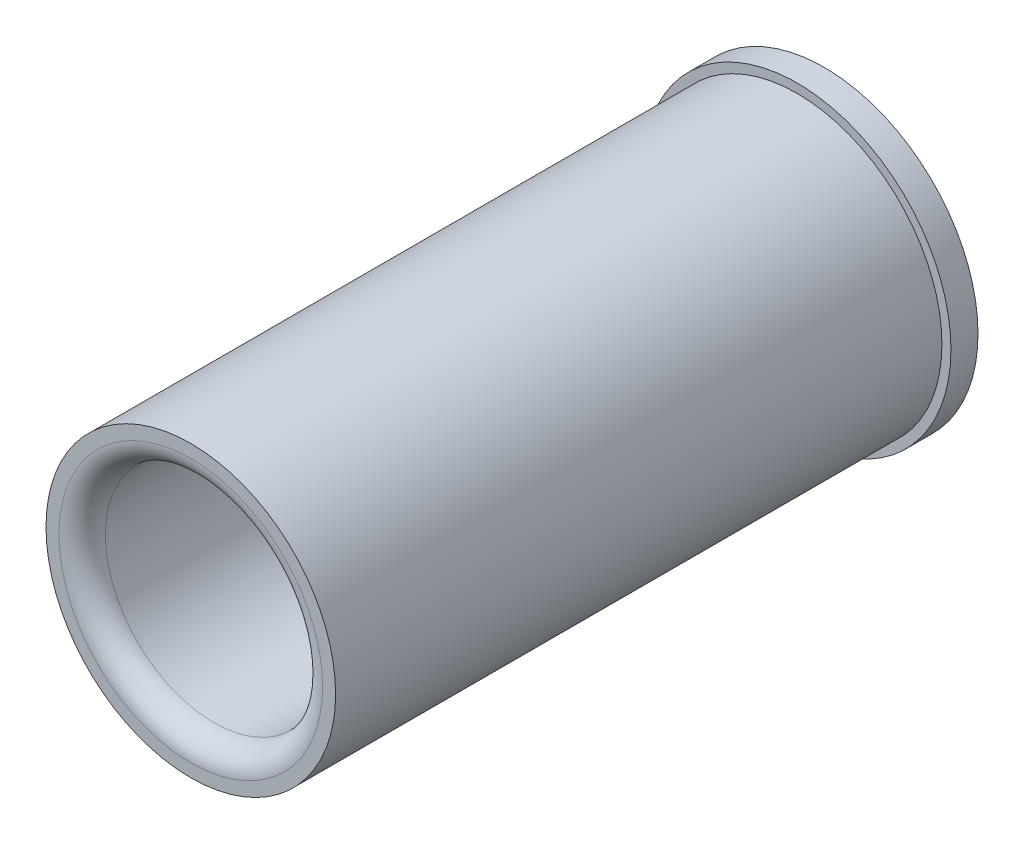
ISO-10303-21;
HEADER;
FILE_DESCRIPTION(('STEP AP214'),'2;1');
FILE_NAME('part.step','',(''),(''),'','','');
FILE_SCHEMA(('AUTOMOTIVE_DESIGN { 1 0 10303 214 1 1 1 1 }'));
ENDSEC;
DATA;
#1=APPLICATION_CONTEXT('core data for automotive mechanical design processes');
#2=APPLICATION_PROTOCOL_DEFINITION('international standard','automotive_design',2000,#1);
#3=PRODUCT_CONTEXT('',#1,'mechanical');
#4=PRODUCT('Part','Part','',(#3));
#5=PRODUCT_RELATED_PRODUCT_CATEGORY('part','',(#4));
#6=PRODUCT_DEFINITION_FORMATION('','',#4);
#7=PRODUCT_DEFINITION_CONTEXT('part definition',#1,'design');
#8=PRODUCT_DEFINITION('design','',#6,#7);
#9=PRODUCT_DEFINITION_SHAPE('','',#8);
#10=(LENGTH_UNIT() NAMED_UNIT(*) SI_UNIT(.MILLI.,.METRE.));
#11=(NAMED_UNIT(*) PLANE_ANGLE_UNIT() SI_UNIT($,.RADIAN.));
#12=(NAMED_UNIT(*) SI_UNIT($,.STERADIAN.) SOLID_ANGLE_UNIT());
#13=UNCERTAINTY_MEASURE_WITH_UNIT(LENGTH_MEASURE(1.E-05),#10,'distance_accuracy_value','');
#14=(GEOMETRIC_REPRESENTATION_CONTEXT(3) GLOBAL_UNCERTAINTY_ASSIGNED_CONTEXT((#13)) GLOBAL_UNIT_ASSIGNED_CONTEXT((#10,
#11,#12)) REPRESENTATION_CONTEXT('',''));
#15=CARTESIAN_POINT('',(0.,0.,0.));
#16=DIRECTION('',(0.,0.,1.));
#17=DIRECTION('',(1.,0.,0.));
#18=AXIS2_PLACEMENT_3D('',#15,#16,#17);
#19=CARTESIAN_POINT('',(0.,0.,111.125));
#20=DIRECTION('',(0.,0.,-1.));
#21=DIRECTION('',(-1.,0.,0.));
#22=AXIS2_PLACEMENT_3D('',#19,#20,#21);
#23=CYLINDRICAL_SURFACE('',#22,25.40635);
#24=CARTESIAN_POINT('',(0.,0.,4.7498));
#25=DIRECTION('',(0.,0.,1.));
#26=DIRECTION('',(1.,0.,0.));
#27=AXIS2_PLACEMENT_3D('',#24,#25,#26);
#28=CIRCLE('',#27,25.40635);
#29=CARTESIAN_POINT('',(25.40635,0.,4.7498));
#30=VERTEX_POINT('',#29);
#31=EDGE_CURVE('E70',#30,#30,#28,.T.);
#32=ORIENTED_EDGE('',*,*,#31,.T.);
#33=EDGE_LOOP('',(#32));
#34=FACE_BOUND('',#33,.T.);
#35=CARTESIAN_POINT('',(0.,0.,111.125));
#36=DIRECTION('',(0.,0.,1.));
#37=DIRECTION('',(1.,0.,0.));
#38=AXIS2_PLACEMENT_3D('',#35,#36,#37);
#39=CIRCLE('',#38,25.40635);
#40=CARTESIAN_POINT('',(25.40635,0.,111.125));
#41=VERTEX_POINT('',#40);
#42=EDGE_CURVE('E64',#41,#41,#39,.T.);
#43=ORIENTED_EDGE('',*,*,#42,.F.);
#44=EDGE_LOOP('',(#43));
#45=FACE_BOUND('',#44,.T.);
#46=ADVANCED_FACE('F36',(#34,#45),#23,.T.);
#47=CARTESIAN_POINT('',(0.,0.,111.125));
#48=DIRECTION('',(0.,0.,1.));
#49=DIRECTION('',(1.,0.,0.));
#50=AXIS2_PLACEMENT_3D('',#47,#48,#49);
#51=PLANE('',#50);
#52=CARTESIAN_POINT('',(0.,0.,111.125));
#53=DIRECTION('',(0.,0.,1.));
#54=DIRECTION('',(1.,0.,0.));
#55=AXIS2_PLACEMENT_3D('',#52,#53,#54);
#56=CIRCLE('',#55,23.12035);
#57=CARTESIAN_POINT('',(23.12035,0.,111.125));
#58=VERTEX_POINT('',#57);
#59=EDGE_CURVE('E50',#58,#58,#56,.F.);
#60=ORIENTED_EDGE('',*,*,#59,.T.);
#61=EDGE_LOOP('',(#60));
#62=FACE_BOUND('',#61,.T.);
#63=ORIENTED_EDGE('',*,*,#42,.T.);
#64=EDGE_LOOP('',(#63));
#65=FACE_BOUND('',#64,.T.);
#66=ADVANCED_FACE('F90',(#62,#65),#51,.T.);
#67=CARTESIAN_POINT('',(0.,0.,4.7498));
#68=DIRECTION('',(0.,0.,-1.));
#69=DIRECTION('',(-1.,0.,0.));
#70=AXIS2_PLACEMENT_3D('',#67,#68,#69);
#71=CYLINDRICAL_SURFACE('',#70,26.9875);
#72=CARTESIAN_POINT('',(0.,0.,4.7498));
#73=DIRECTION('',(0.,0.,1.));
#74=DIRECTION('',(1.,0.,0.));
#75=AXIS2_PLACEMENT_3D('',#72,#73,#74);
#76=CIRCLE('',#75,26.9875);
#77=CARTESIAN_POINT('',(26.9875,0.,4.7498));
#78=VERTEX_POINT('',#77);
#79=EDGE_CURVE('E74',#78,#78,#76,.T.);
#80=ORIENTED_EDGE('',*,*,#79,.F.);
#81=EDGE_LOOP('',(#80));
#82=FACE_BOUND('',#81,.T.);
#83=CARTESIAN_POINT('',(0.,0.,0.));
#84=DIRECTION('',(0.,0.,1.));
#85=DIRECTION('',(1.,0.,0.));
#86=AXIS2_PLACEMENT_3D('',#83,#84,#85);
#87=CIRCLE('',#86,26.9875);
#88=CARTESIAN_POINT('',(26.9875,0.,0.));
#89=VERTEX_POINT('',#88);
#90=EDGE_CURVE('E69',#89,#89,#87,.T.);
#91=ORIENTED_EDGE('',*,*,#90,.T.);
#92=EDGE_LOOP('',(#91));
#93=FACE_BOUND('',#92,.T.);
#94=ADVANCED_FACE('F87',(#82,#93),#71,.T.);
#95=CARTESIAN_POINT('',(0.,0.,4.7498));
#96=DIRECTION('',(0.,0.,1.));
#97=DIRECTION('',(1.,0.,0.));
#98=AXIS2_PLACEMENT_3D('',#95,#96,#97);
#99=PLANE('',#98);
#100=ORIENTED_EDGE('',*,*,#31,.F.);
#101=EDGE_LOOP('',(#100));
#102=FACE_BOUND('',#101,.T.);
#103=ORIENTED_EDGE('',*,*,#79,.T.);
#104=EDGE_LOOP('',(#103));
#105=FACE_BOUND('',#104,.T.);
#106=ADVANCED_FACE('F85',(#102,#105),#99,.T.);
#107=CARTESIAN_POINT('',(0.,0.,0.));
#108=DIRECTION('',(0.,0.,1.));
#109=DIRECTION('',(1.,0.,0.));
#110=AXIS2_PLACEMENT_3D('',#107,#108,#109);
#111=PLANE('',#110);
#112=CARTESIAN_POINT('',(0.,0.,0.));
#113=DIRECTION('',(0.,0.,1.));
#114=DIRECTION('',(1.,0.,0.));
#115=AXIS2_PLACEMENT_3D('',#112,#113,#114);
#116=CIRCLE('',#115,20.955);
#117=CARTESIAN_POINT('',(20.955,0.,0.));
#118=VERTEX_POINT('',#117);
#119=EDGE_CURVE('E11',#118,#118,#116,.T.);
#120=ORIENTED_EDGE('',*,*,#119,.T.);
#121=EDGE_LOOP('',(#120));
#122=FACE_BOUND('',#121,.T.);
#123=ORIENTED_EDGE('',*,*,#90,.F.);
#124=EDGE_LOOP('',(#123));
#125=FACE_BOUND('',#124,.T.);
#126=ADVANCED_FACE('F94',(#122,#125),#111,.F.);
#127=CARTESIAN_POINT('',(0.,0.,111.125));
#128=DIRECTION('',(0.,0.,-1.));
#129=DIRECTION('',(-1.,0.,0.));
#130=AXIS2_PLACEMENT_3D('',#127,#128,#129);
#131=CYLINDRICAL_SURFACE('',#130,19.05635);
#132=CARTESIAN_POINT('',(0.,0.,107.061));
#133=DIRECTION('',(0.,0.,1.));
#134=DIRECTION('',(1.,0.,0.));
#135=AXIS2_PLACEMENT_3D('',#132,#133,#134);
#136=CIRCLE('',#135,19.05635);
#137=CARTESIAN_POINT('',(19.05635,0.,107.061));
#138=VERTEX_POINT('',#137);
#139=EDGE_CURVE('E54',#138,#138,#136,.T.);
#140=ORIENTED_EDGE('',*,*,#139,.T.);
#141=EDGE_LOOP('',(#140));
#142=FACE_BOUND('',#141,.T.);
#143=CARTESIAN_POINT('',(0.,0.,34.925));
#144=DIRECTION('',(0.,0.,1.));
#145=DIRECTION('',(1.,0.,0.));
#146=AXIS2_PLACEMENT_3D('',#143,#144,#145);
#147=CIRCLE('',#146,19.05635);
#148=CARTESIAN_POINT('',(19.05635,0.,34.925));
#149=VERTEX_POINT('',#148);
#150=EDGE_CURVE('E65',#149,#149,#147,.T.);
#151=ORIENTED_EDGE('',*,*,#150,.F.);
#152=EDGE_LOOP('',(#151));
#153=FACE_BOUND('',#152,.T.);
#154=ADVANCED_FACE('F96',(#142,#153),#131,.F.);
#155=CARTESIAN_POINT('',(0.,0.,166.084167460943));
#156=DIRECTION('',(0.,0.,-1.));
#157=DIRECTION('',(-1.,0.,0.));
#158=AXIS2_PLACEMENT_3D('',#155,#156,#157);
#159=CYLINDRICAL_SURFACE('',#158,19.431);
#160=CARTESIAN_POINT('',(0.,0.,1.52399999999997));
#161=DIRECTION('',(0.,0.,1.));
#162=DIRECTION('',(1.,0.,0.));
#163=AXIS2_PLACEMENT_3D('',#160,#161,#162);
#164=CIRCLE('',#163,19.431);
#165=CARTESIAN_POINT('',(19.431,0.,1.52399999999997));
#166=VERTEX_POINT('',#165);
#167=EDGE_CURVE('E44',#166,#166,#164,.F.);
#168=ORIENTED_EDGE('',*,*,#167,.T.);
#169=EDGE_LOOP('',(#168));
#170=FACE_BOUND('',#169,.T.);
#171=CARTESIAN_POINT('',(0.,0.,34.4348145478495));
#172=DIRECTION('',(0.,0.,1.));
#173=DIRECTION('',(1.,0.,0.));
#174=AXIS2_PLACEMENT_3D('',#171,#172,#173);
#175=CIRCLE('',#174,19.431);
#176=CARTESIAN_POINT('',(19.431,0.,34.4348145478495));
#177=VERTEX_POINT('',#176);
#178=EDGE_CURVE('E60',#177,#177,#175,.T.);
#179=ORIENTED_EDGE('',*,*,#178,.T.);
#180=EDGE_LOOP('',(#179));
#181=FACE_BOUND('',#180,.T.);
#182=ADVANCED_FACE('F102',(#170,#181),#159,.F.);
#183=CARTESIAN_POINT('',(0.,0.,34.4348145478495));
#184=DIRECTION('',(0.,0.,1.));
#185=DIRECTION('',(1.,0.,0.));
#186=AXIS2_PLACEMENT_3D('',#183,#184,#185);
#187=TOROIDAL_SURFACE('',#186,18.923,0.508);
#188=ORIENTED_EDGE('',*,*,#178,.F.);
#189=EDGE_LOOP('',(#188));
#190=FACE_BOUND('',#189,.T.);
#191=ORIENTED_EDGE('',*,*,#150,.T.);
#192=EDGE_LOOP('',(#191));
#193=FACE_BOUND('',#192,.T.);
#194=ADVANCED_FACE('F117',(#190,#193),#187,.F.);
#195=CARTESIAN_POINT('',(0.,0.,107.061));
#196=DIRECTION('',(0.,0.,1.));
#197=DIRECTION('',(1.,0.,0.));
#198=AXIS2_PLACEMENT_3D('',#195,#196,#197);
#199=TOROIDAL_SURFACE('',#198,23.12035,4.064);
#200=ORIENTED_EDGE('',*,*,#59,.F.);
#201=EDGE_LOOP('',(#200));
#202=FACE_BOUND('',#201,.T.);
#203=ORIENTED_EDGE('',*,*,#139,.F.);
#204=EDGE_LOOP('',(#203));
#205=FACE_BOUND('',#204,.T.);
#206=ADVANCED_FACE('F119',(#202,#205),#199,.T.);
#207=CARTESIAN_POINT('',(0.,0.,1.52399999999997));
#208=DIRECTION('',(0.,0.,-1.));
#209=DIRECTION('',(-1.,0.,0.));
#210=AXIS2_PLACEMENT_3D('',#207,#208,#209);
#211=CONICAL_SURFACE('',#210,19.431,0.785398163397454);
#212=ORIENTED_EDGE('',*,*,#119,.F.);
#213=EDGE_LOOP('',(#212));
#214=FACE_BOUND('',#213,.T.);
#215=ORIENTED_EDGE('',*,*,#167,.F.);
#216=EDGE_LOOP('',(#215));
#217=FACE_BOUND('',#216,.T.);
#218=ADVANCED_FACE('F38',(#214,#217),#211,.F.);
#219=CLOSED_SHELL('',(#46,#66,#94,#106,#126,#154,#182,#194,#206,#218));
#220=MANIFOLD_SOLID_BREP('B2',#219);
#221=ADVANCED_BREP_SHAPE_REPRESENTATION('',(#18,#220),#14);
#222=SHAPE_DEFINITION_REPRESENTATION(#9,#221);
ENDSEC;
END-ISO-10303-21;
